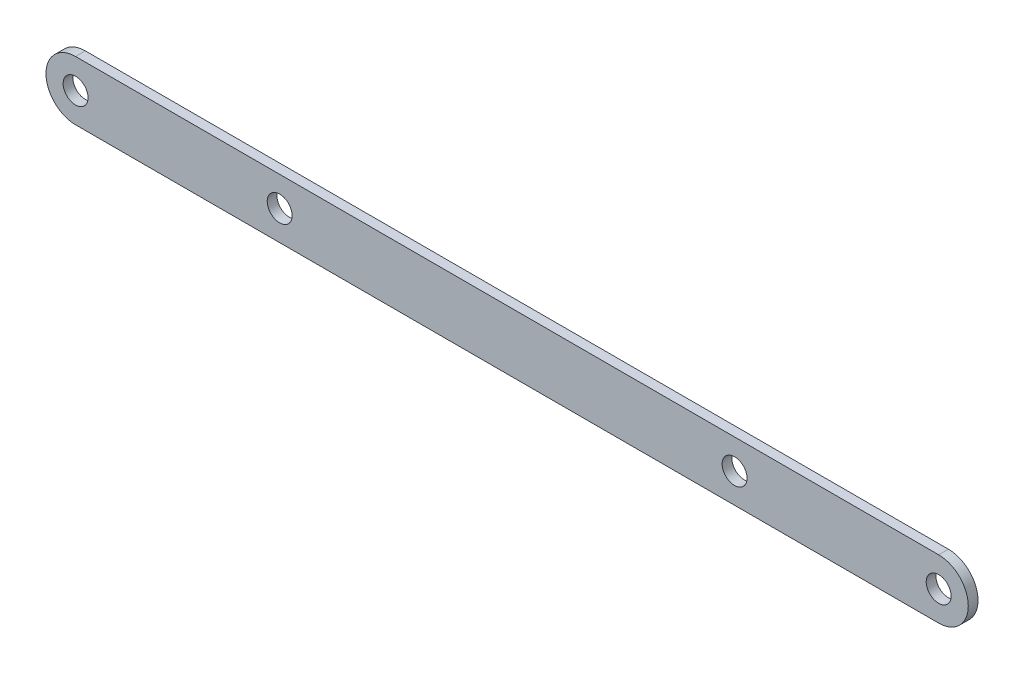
from build123d import *

# Parameters (mm, degrees)
SKETCH1_R           = 2.032
BOSS_EXTRUDE1_DEPTH = 1.5875


with BuildPart() as part:
    # Sketch1 → Boss-Extrude1 (new body)
    with BuildSketch(Plane.XY):
        with BuildLine():
            Line((-148.38, -7.874), (-7.62, -7.874))
            ThreePointArc((-7.62, -7.874), (-2.794, -12.7), (-7.62, -17.526))
            Line((-7.62, -17.526), (-148.38, -17.526))
            ThreePointArc((-148.38, -17.526), (-153.206, -12.7), (-148.38, -7.874))
        make_face()
        with Locations((-148.38, -12.7)):
            Circle(SKETCH1_R, mode=Mode.SUBTRACT)
        with Locations((-115.095, -12.7)):
            Circle(SKETCH1_R, mode=Mode.SUBTRACT)
        with Locations((-40.905, -12.7)):
            Circle(SKETCH1_R, mode=Mode.SUBTRACT)
        with Locations((-7.62, -12.7)):
            Circle(SKETCH1_R, mode=Mode.SUBTRACT)
    extrude(amount=BOSS_EXTRUDE1_DEPTH)


solid = part.part
